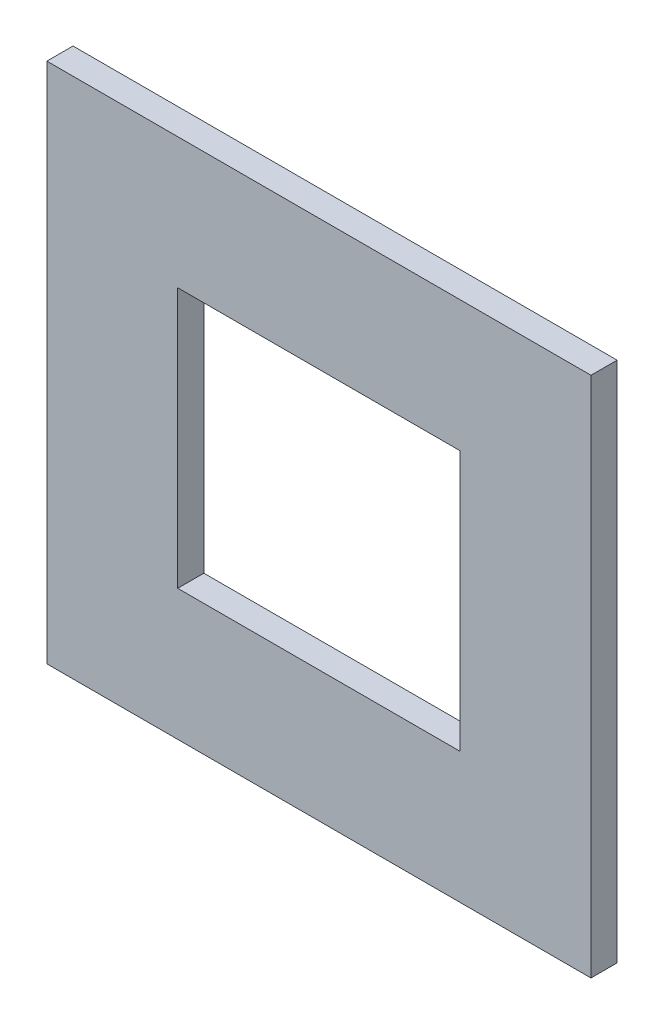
from build123d import *

# Parameters (mm, degrees)
SKETCH1_W           = 1407.485243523
SKETCH1_H           = 1128.959139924
SKETCH1_W_2         = 161.925
SKETCH1_H_2         = 149.225
BOSS_EXTRUDE1_DEPTH = 15
SKETCH2_W           = 1634.850849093
SKETCH2_H           = 1414.029762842
SKETCH2_W_2         = 311.9374
SKETCH2_H_2         = 299.2374
CUT_EXTRUDE1_DEPTH  = 1080.206832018


with BuildPart() as part:
    # Sketch1 → Boss-Extrude1 (new body)
    with BuildSketch(Plane.XY):
        with Locations((64.619518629, -193.202426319)):
            Rectangle(SKETCH1_W, SKETCH1_H)
        Rectangle(SKETCH1_W_2, SKETCH1_H_2, mode=Mode.SUBTRACT)
    extrude(amount=BOSS_EXTRUDE1_DEPTH)

    # Sketch2 → Cut-Extrude1 (cut, through all)
    with BuildSketch(Plane(origin=(0, 0, 0), x_dir=(-1, 0, 0), z_dir=(0, 0, -1))):
        with Locations((-17.147082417, -252.403097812)):
            Rectangle(SKETCH2_W, SKETCH2_H)
        Rectangle(SKETCH2_W_2, SKETCH2_H_2, mode=Mode.SUBTRACT)
    extrude(amount=-CUT_EXTRUDE1_DEPTH, mode=Mode.SUBTRACT)


solid = part.part
